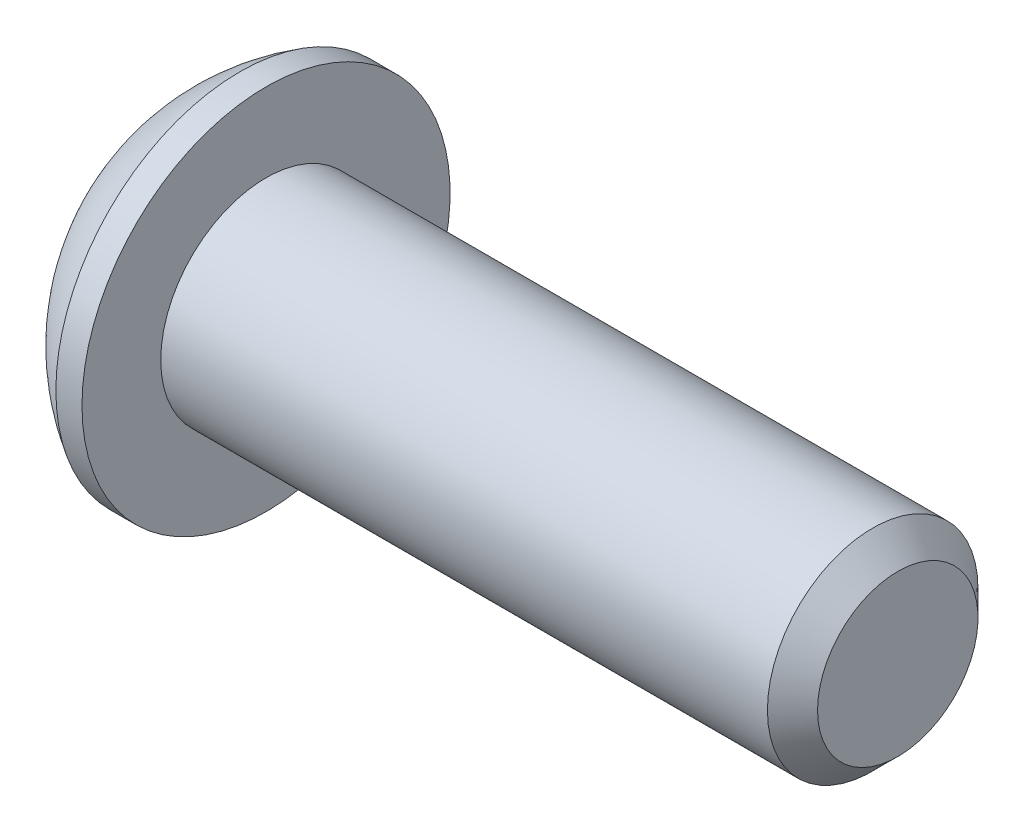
from build123d import *

# Parameters (mm, degrees)
HEX_2_DEPTH = 2.2098


with BuildPart() as part:
    # BodySke → BaseBody (revolve)
    with BuildSketch(Plane.XY, mode=Mode.PRIVATE) as basebody_sk:
        with BuildLine():
            Line((22.4028, 0), (22.4028, 2.41935))
            Line((22.4028, 2.41935), (21.64715, 3.175))
            Line((21.64715, 3.175), (3.3528, 3.175))
            Line((3.3528, 3.175), (3.3528, 5.5499))
            Line((3.3528, 5.5499), (2.5654, 5.5499))
            ThreePointArc((2.5654, 5.5499), (1.073764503, 4.355582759), (0, 2.77495))
            Line((0, 2.77495), (0, 0))
            Line((0, 0), (22.4028, 0))
        make_face()
    revolve(basebody_sk.sketch.rotate(Axis((0, 0, 0), (1, 0, 0)), 90), axis=Axis((0, 0, 0), (1, 0, 0)))

    # Sketch2 → PreBroach (revolve, cut)
    with BuildSketch(Plane.XY, mode=Mode.PRIVATE) as prebroach_sk:
        Polygon((0, 1.9812), (2.2098, 1.9812), (3.353646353, 0), (0, 0), align=None)
    revolve(prebroach_sk.sketch.rotate(Axis((0, 0, 0), (1, 0, 0)), 90), axis=Axis((0, 0, 0), (1, 0, 0)), mode=Mode.SUBTRACT)

    # Sketch3 → Hex 2 (cut)
    with BuildSketch(Plane(origin=(0, 0, 0), x_dir=(0, 0, -1), z_dir=(1, 0, 0))):
        Polygon((-1.9812, -1.143846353), (-1.9812, 1.143846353), (0, 2.287692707), (1.9812, 1.143846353), (1.9812, -1.143846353), (0, -2.287692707), align=None)
    extrude(amount=HEX_2_DEPTH, mode=Mode.SUBTRACT)


solid = part.part
